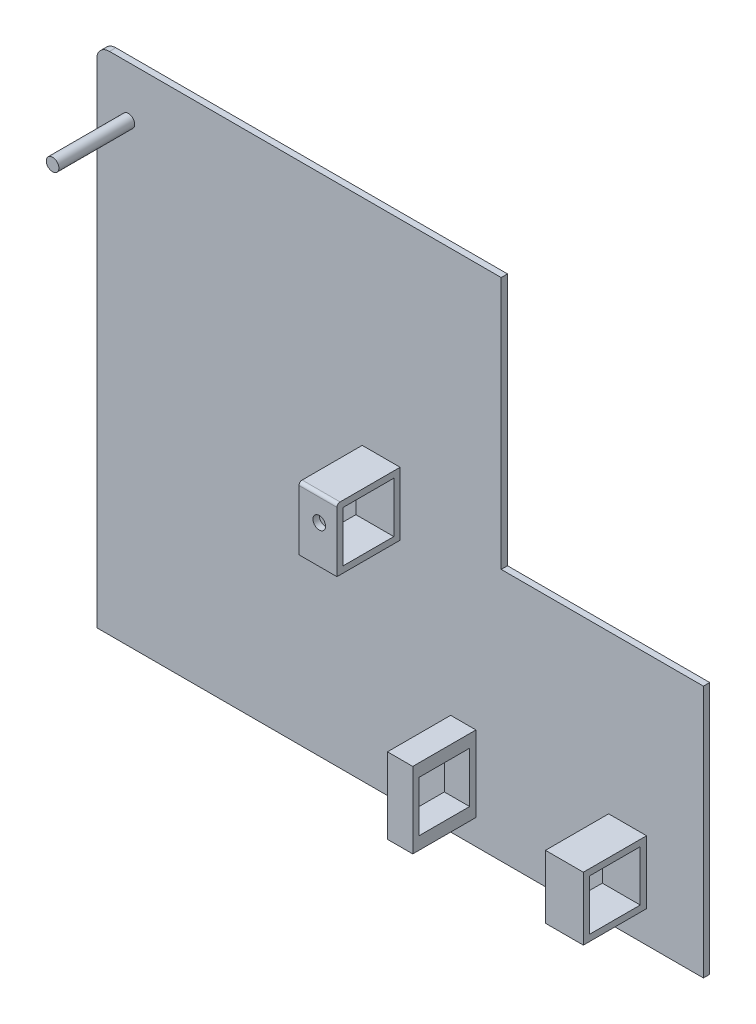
ISO-10303-21;
HEADER;
FILE_DESCRIPTION(('STEP AP214'),'2;1');
FILE_NAME('part.step','',(''),(''),'','','');
FILE_SCHEMA(('AUTOMOTIVE_DESIGN { 1 0 10303 214 1 1 1 1 }'));
ENDSEC;
DATA;
#1=APPLICATION_CONTEXT('core data for automotive mechanical design processes');
#2=APPLICATION_PROTOCOL_DEFINITION('international standard','automotive_design',2000,#1);
#3=PRODUCT_CONTEXT('',#1,'mechanical');
#4=PRODUCT('Part','Part','',(#3));
#5=PRODUCT_RELATED_PRODUCT_CATEGORY('part','',(#4));
#6=PRODUCT_DEFINITION_FORMATION('','',#4);
#7=PRODUCT_DEFINITION_CONTEXT('part definition',#1,'design');
#8=PRODUCT_DEFINITION('design','',#6,#7);
#9=PRODUCT_DEFINITION_SHAPE('','',#8);
#10=(LENGTH_UNIT() NAMED_UNIT(*) SI_UNIT(.MILLI.,.METRE.));
#11=(NAMED_UNIT(*) PLANE_ANGLE_UNIT() SI_UNIT($,.RADIAN.));
#12=(NAMED_UNIT(*) SI_UNIT($,.STERADIAN.) SOLID_ANGLE_UNIT());
#13=UNCERTAINTY_MEASURE_WITH_UNIT(LENGTH_MEASURE(1.E-05),#10,'distance_accuracy_value','');
#14=(GEOMETRIC_REPRESENTATION_CONTEXT(3) GLOBAL_UNCERTAINTY_ASSIGNED_CONTEXT((#13)) GLOBAL_UNIT_ASSIGNED_CONTEXT((#10,
#11,#12)) REPRESENTATION_CONTEXT('',''));
#15=CARTESIAN_POINT('',(0.,0.,0.));
#16=DIRECTION('',(0.,0.,1.));
#17=DIRECTION('',(1.,0.,0.));
#18=AXIS2_PLACEMENT_3D('',#15,#16,#17);
#19=CARTESIAN_POINT('',(152.4,-25.4,33.3375));
#20=DIRECTION('',(-1.,0.,0.));
#21=DIRECTION('',(0.,0.,1.));
#22=AXIS2_PLACEMENT_3D('',#19,#20,#21);
#23=PLANE('',#22);
#24=DIRECTION('',(0.,-1.,0.));
#25=VECTOR('',#24,1.);
#26=CARTESIAN_POINT('',(152.4,-63.5,33.3375));
#27=LINE('',#26,#25);
#28=CARTESIAN_POINT('',(152.4,-25.4,33.3375));
#29=VERTEX_POINT('',#28);
#30=CARTESIAN_POINT('',(152.4,-63.5,33.3375));
#31=VERTEX_POINT('',#30);
#32=EDGE_CURVE('E146',#29,#31,#27,.T.);
#33=ORIENTED_EDGE('',*,*,#32,.T.);
#34=DIRECTION('',(0.,0.,-1.));
#35=VECTOR('',#34,1.);
#36=CARTESIAN_POINT('',(152.4,-63.5,1.5875));
#37=LINE('',#36,#35);
#38=CARTESIAN_POINT('',(152.4,-63.5,1.5875));
#39=VERTEX_POINT('',#38);
#40=EDGE_CURVE('E149',#31,#39,#37,.T.);
#41=ORIENTED_EDGE('',*,*,#40,.T.);
#42=DIRECTION('',(0.,1.,0.));
#43=VECTOR('',#42,1.);
#44=CARTESIAN_POINT('',(152.4,-25.4,1.5875));
#45=LINE('',#44,#43);
#46=CARTESIAN_POINT('',(152.4,-25.4,1.5875));
#47=VERTEX_POINT('',#46);
#48=EDGE_CURVE('E152',#39,#47,#45,.T.);
#49=ORIENTED_EDGE('',*,*,#48,.T.);
#50=DIRECTION('',(0.,0.,1.));
#51=VECTOR('',#50,1.);
#52=CARTESIAN_POINT('',(152.4,-25.4,33.3375));
#53=LINE('',#52,#51);
#54=EDGE_CURVE('E154',#47,#29,#53,.T.);
#55=ORIENTED_EDGE('',*,*,#54,.T.);
#56=EDGE_LOOP('',(#33,#41,#49,#55));
#57=FACE_BOUND('',#56,.T.);
#58=DIRECTION('',(0.,-1.,0.));
#59=VECTOR('',#58,1.);
#60=CARTESIAN_POINT('',(152.4,-57.15,30.1625));
#61=LINE('',#60,#59);
#62=CARTESIAN_POINT('',(152.4,-31.75,30.1625));
#63=VERTEX_POINT('',#62);
#64=CARTESIAN_POINT('',(152.4,-57.15,30.1625));
#65=VERTEX_POINT('',#64);
#66=EDGE_CURVE('E110',#63,#65,#61,.T.);
#67=ORIENTED_EDGE('',*,*,#66,.F.);
#68=DIRECTION('',(0.,0.,1.));
#69=VECTOR('',#68,1.);
#70=CARTESIAN_POINT('',(152.4,-31.75,30.1625));
#71=LINE('',#70,#69);
#72=CARTESIAN_POINT('',(152.4,-31.75,4.7625));
#73=VERTEX_POINT('',#72);
#74=EDGE_CURVE('E132',#73,#63,#71,.T.);
#75=ORIENTED_EDGE('',*,*,#74,.F.);
#76=DIRECTION('',(0.,1.,0.));
#77=VECTOR('',#76,1.);
#78=CARTESIAN_POINT('',(152.4,-31.75,4.7625));
#79=LINE('',#78,#77);
#80=CARTESIAN_POINT('',(152.4,-57.15,4.7625));
#81=VERTEX_POINT('',#80);
#82=EDGE_CURVE('E130',#81,#73,#79,.T.);
#83=ORIENTED_EDGE('',*,*,#82,.F.);
#84=DIRECTION('',(0.,0.,-1.));
#85=VECTOR('',#84,1.);
#86=CARTESIAN_POINT('',(152.4,-57.15,4.7625));
#87=LINE('',#86,#85);
#88=EDGE_CURVE('E118',#65,#81,#87,.T.);
#89=ORIENTED_EDGE('',*,*,#88,.F.);
#90=EDGE_LOOP('',(#67,#75,#83,#89));
#91=FACE_BOUND('',#90,.T.);
#92=ADVANCED_FACE('F45',(#57,#91),#23,.F.);
#93=CARTESIAN_POINT('',(139.7,-25.4,33.3375));
#94=DIRECTION('',(-1.,0.,0.));
#95=DIRECTION('',(0.,0.,1.));
#96=AXIS2_PLACEMENT_3D('',#93,#94,#95);
#97=PLANE('',#96);
#98=DIRECTION('',(0.,-1.,0.));
#99=VECTOR('',#98,1.);
#100=CARTESIAN_POINT('',(139.7,-63.5,33.3375));
#101=LINE('',#100,#99);
#102=CARTESIAN_POINT('',(139.7,-25.4,33.3375));
#103=VERTEX_POINT('',#102);
#104=CARTESIAN_POINT('',(139.7,-63.5,33.3375));
#105=VERTEX_POINT('',#104);
#106=EDGE_CURVE('E126',#103,#105,#101,.T.);
#107=ORIENTED_EDGE('',*,*,#106,.F.);
#108=DIRECTION('',(0.,0.,1.));
#109=VECTOR('',#108,1.);
#110=CARTESIAN_POINT('',(139.7,-25.4,33.3375));
#111=LINE('',#110,#109);
#112=CARTESIAN_POINT('',(139.7,-25.4,1.5875));
#113=VERTEX_POINT('',#112);
#114=EDGE_CURVE('E150',#113,#103,#111,.T.);
#115=ORIENTED_EDGE('',*,*,#114,.F.);
#116=DIRECTION('',(0.,1.,0.));
#117=VECTOR('',#116,1.);
#118=CARTESIAN_POINT('',(139.7,-25.4,1.5875));
#119=LINE('',#118,#117);
#120=CARTESIAN_POINT('',(139.7,-63.5,1.5875));
#121=VERTEX_POINT('',#120);
#122=EDGE_CURVE('E161',#121,#113,#119,.T.);
#123=ORIENTED_EDGE('',*,*,#122,.F.);
#124=DIRECTION('',(0.,0.,-1.));
#125=VECTOR('',#124,1.);
#126=CARTESIAN_POINT('',(139.7,-63.5,1.5875));
#127=LINE('',#126,#125);
#128=EDGE_CURVE('E159',#105,#121,#127,.T.);
#129=ORIENTED_EDGE('',*,*,#128,.F.);
#130=EDGE_LOOP('',(#107,#115,#123,#129));
#131=FACE_BOUND('',#130,.T.);
#132=DIRECTION('',(0.,0.,1.));
#133=VECTOR('',#132,1.);
#134=CARTESIAN_POINT('',(139.7,-31.75,30.1625));
#135=LINE('',#134,#133);
#136=CARTESIAN_POINT('',(139.7,-31.75,4.7625));
#137=VERTEX_POINT('',#136);
#138=CARTESIAN_POINT('',(139.7,-31.75,30.1625));
#139=VERTEX_POINT('',#138);
#140=EDGE_CURVE('E119',#137,#139,#135,.T.);
#141=ORIENTED_EDGE('',*,*,#140,.T.);
#142=DIRECTION('',(0.,-1.,0.));
#143=VECTOR('',#142,1.);
#144=CARTESIAN_POINT('',(139.7,-57.15,30.1625));
#145=LINE('',#144,#143);
#146=CARTESIAN_POINT('',(139.7,-57.15,30.1625));
#147=VERTEX_POINT('',#146);
#148=EDGE_CURVE('E68',#139,#147,#145,.T.);
#149=ORIENTED_EDGE('',*,*,#148,.T.);
#150=DIRECTION('',(0.,0.,-1.));
#151=VECTOR('',#150,1.);
#152=CARTESIAN_POINT('',(139.7,-57.15,4.7625));
#153=LINE('',#152,#151);
#154=CARTESIAN_POINT('',(139.7,-57.15,4.7625));
#155=VERTEX_POINT('',#154);
#156=EDGE_CURVE('E125',#147,#155,#153,.T.);
#157=ORIENTED_EDGE('',*,*,#156,.T.);
#158=DIRECTION('',(0.,1.,0.));
#159=VECTOR('',#158,1.);
#160=CARTESIAN_POINT('',(139.7,-31.75,4.7625));
#161=LINE('',#160,#159);
#162=EDGE_CURVE('E138',#155,#137,#161,.T.);
#163=ORIENTED_EDGE('',*,*,#162,.T.);
#164=EDGE_LOOP('',(#141,#149,#157,#163));
#165=FACE_BOUND('',#164,.T.);
#166=ADVANCED_FACE('F179',(#131,#165),#97,.T.);
#167=CARTESIAN_POINT('',(152.4,-63.5,33.3375));
#168=DIRECTION('',(0.,0.,-1.));
#169=DIRECTION('',(0.,1.,0.));
#170=AXIS2_PLACEMENT_3D('',#167,#168,#169);
#171=PLANE('',#170);
#172=ORIENTED_EDGE('',*,*,#106,.T.);
#173=DIRECTION('',(-1.,0.,0.));
#174=VECTOR('',#173,1.);
#175=CARTESIAN_POINT('',(152.4,-63.5,33.3375));
#176=LINE('',#175,#174);
#177=EDGE_CURVE('E12',#31,#105,#176,.T.);
#178=ORIENTED_EDGE('',*,*,#177,.F.);
#179=ORIENTED_EDGE('',*,*,#32,.F.);
#180=DIRECTION('',(-1.,0.,0.));
#181=VECTOR('',#180,1.);
#182=CARTESIAN_POINT('',(152.4,-25.4,33.3375));
#183=LINE('',#182,#181);
#184=EDGE_CURVE('E156',#29,#103,#183,.T.);
#185=ORIENTED_EDGE('',*,*,#184,.T.);
#186=EDGE_LOOP('',(#172,#178,#179,#185));
#187=FACE_BOUND('',#186,.T.);
#188=ADVANCED_FACE('F47',(#187),#171,.F.);
#189=CARTESIAN_POINT('',(152.4,-63.5,1.5875));
#190=DIRECTION('',(0.,1.,0.));
#191=DIRECTION('',(0.,0.,1.));
#192=AXIS2_PLACEMENT_3D('',#189,#190,#191);
#193=PLANE('',#192);
#194=ORIENTED_EDGE('',*,*,#128,.T.);
#195=DIRECTION('',(-1.,0.,0.));
#196=VECTOR('',#195,1.);
#197=CARTESIAN_POINT('',(152.4,-63.5,1.5875));
#198=LINE('',#197,#196);
#199=EDGE_CURVE('E53',#39,#121,#198,.T.);
#200=ORIENTED_EDGE('',*,*,#199,.F.);
#201=ORIENTED_EDGE('',*,*,#40,.F.);
#202=ORIENTED_EDGE('',*,*,#177,.T.);
#203=EDGE_LOOP('',(#194,#200,#201,#202));
#204=FACE_BOUND('',#203,.T.);
#205=ADVANCED_FACE('F189',(#204),#193,.F.);
#206=CARTESIAN_POINT('',(152.4,-25.4,1.5875));
#207=DIRECTION('',(0.,0.,1.));
#208=DIRECTION('',(0.,-1.,0.));
#209=AXIS2_PLACEMENT_3D('',#206,#207,#208);
#210=PLANE('',#209);
#211=ORIENTED_EDGE('',*,*,#122,.T.);
#212=DIRECTION('',(-1.,0.,0.));
#213=VECTOR('',#212,1.);
#214=CARTESIAN_POINT('',(152.4,-25.4,1.5875));
#215=LINE('',#214,#213);
#216=EDGE_CURVE('E166',#47,#113,#215,.T.);
#217=ORIENTED_EDGE('',*,*,#216,.F.);
#218=ORIENTED_EDGE('',*,*,#48,.F.);
#219=ORIENTED_EDGE('',*,*,#199,.T.);
#220=EDGE_LOOP('',(#211,#217,#218,#219));
#221=FACE_BOUND('',#220,.T.);
#222=ADVANCED_FACE('F173',(#221),#210,.F.);
#223=CARTESIAN_POINT('',(152.4,-25.4,33.3375));
#224=DIRECTION('',(0.,-1.,0.));
#225=DIRECTION('',(0.,0.,-1.));
#226=AXIS2_PLACEMENT_3D('',#223,#224,#225);
#227=PLANE('',#226);
#228=ORIENTED_EDGE('',*,*,#114,.T.);
#229=ORIENTED_EDGE('',*,*,#184,.F.);
#230=ORIENTED_EDGE('',*,*,#54,.F.);
#231=ORIENTED_EDGE('',*,*,#216,.T.);
#232=EDGE_LOOP('',(#228,#229,#230,#231));
#233=FACE_BOUND('',#232,.T.);
#234=ADVANCED_FACE('F183',(#233),#227,.F.);
#235=CARTESIAN_POINT('',(152.4,-57.15,30.1625));
#236=DIRECTION('',(0.,0.,-1.));
#237=DIRECTION('',(-1.,0.,0.));
#238=AXIS2_PLACEMENT_3D('',#235,#236,#237);
#239=PLANE('',#238);
#240=ORIENTED_EDGE('',*,*,#148,.F.);
#241=DIRECTION('',(-1.,0.,0.));
#242=VECTOR('',#241,1.);
#243=CARTESIAN_POINT('',(152.4,-31.75,30.1625));
#244=LINE('',#243,#242);
#245=EDGE_CURVE('E114',#63,#139,#244,.T.);
#246=ORIENTED_EDGE('',*,*,#245,.F.);
#247=ORIENTED_EDGE('',*,*,#66,.T.);
#248=DIRECTION('',(-1.,0.,0.));
#249=VECTOR('',#248,1.);
#250=CARTESIAN_POINT('',(152.4,-57.15,30.1625));
#251=LINE('',#250,#249);
#252=EDGE_CURVE('E113',#65,#147,#251,.T.);
#253=ORIENTED_EDGE('',*,*,#252,.T.);
#254=EDGE_LOOP('',(#240,#246,#247,#253));
#255=FACE_BOUND('',#254,.T.);
#256=ADVANCED_FACE('F112',(#255),#239,.T.);
#257=CARTESIAN_POINT('',(152.4,-57.15,4.7625));
#258=DIRECTION('',(0.,1.,0.));
#259=DIRECTION('',(0.,0.,1.));
#260=AXIS2_PLACEMENT_3D('',#257,#258,#259);
#261=PLANE('',#260);
#262=ORIENTED_EDGE('',*,*,#156,.F.);
#263=ORIENTED_EDGE('',*,*,#252,.F.);
#264=ORIENTED_EDGE('',*,*,#88,.T.);
#265=DIRECTION('',(-1.,0.,0.));
#266=VECTOR('',#265,1.);
#267=CARTESIAN_POINT('',(152.4,-57.15,4.7625));
#268=LINE('',#267,#266);
#269=EDGE_CURVE('E127',#81,#155,#268,.T.);
#270=ORIENTED_EDGE('',*,*,#269,.T.);
#271=EDGE_LOOP('',(#262,#263,#264,#270));
#272=FACE_BOUND('',#271,.T.);
#273=ADVANCED_FACE('F122',(#272),#261,.T.);
#274=CARTESIAN_POINT('',(152.4,-31.75,4.7625));
#275=DIRECTION('',(0.,0.,1.));
#276=DIRECTION('',(1.,0.,0.));
#277=AXIS2_PLACEMENT_3D('',#274,#275,#276);
#278=PLANE('',#277);
#279=ORIENTED_EDGE('',*,*,#162,.F.);
#280=ORIENTED_EDGE('',*,*,#269,.F.);
#281=ORIENTED_EDGE('',*,*,#82,.T.);
#282=DIRECTION('',(-1.,0.,0.));
#283=VECTOR('',#282,1.);
#284=CARTESIAN_POINT('',(152.4,-31.75,4.7625));
#285=LINE('',#284,#283);
#286=EDGE_CURVE('E60',#73,#137,#285,.T.);
#287=ORIENTED_EDGE('',*,*,#286,.T.);
#288=EDGE_LOOP('',(#279,#280,#281,#287));
#289=FACE_BOUND('',#288,.T.);
#290=ADVANCED_FACE('F212',(#289),#278,.T.);
#291=CARTESIAN_POINT('',(152.4,-31.75,30.1625));
#292=DIRECTION('',(0.,-1.,0.));
#293=DIRECTION('',(0.,0.,-1.));
#294=AXIS2_PLACEMENT_3D('',#291,#292,#293);
#295=PLANE('',#294);
#296=ORIENTED_EDGE('',*,*,#140,.F.);
#297=ORIENTED_EDGE('',*,*,#286,.F.);
#298=ORIENTED_EDGE('',*,*,#74,.T.);
#299=ORIENTED_EDGE('',*,*,#245,.T.);
#300=EDGE_LOOP('',(#296,#297,#298,#299));
#301=FACE_BOUND('',#300,.T.);
#302=ADVANCED_FACE('F216',(#301),#295,.T.);
#303=CLOSED_SHELL('',(#92,#166,#188,#205,#222,#234,#256,#273,#290,#302));
#304=MANIFOLD_SOLID_BREP('B2',#303);
#305=CARTESIAN_POINT('',(95.25,68.2625,31.7500000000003));
#306=DIRECTION('',(-1.,0.,0.));
#307=DIRECTION('',(0.,0.,1.));
#308=AXIS2_PLACEMENT_3D('',#305,#306,#307);
#309=CYLINDRICAL_SURFACE('',#308,1.5875);
#310=DIRECTION('',(-1.,0.,0.));
#311=VECTOR('',#310,1.);
#312=CARTESIAN_POINT('',(95.25,68.2625,33.3375000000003));
#313=LINE('',#312,#311);
#314=CARTESIAN_POINT('',(114.3,68.2625,33.3375000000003));
#315=VERTEX_POINT('',#314);
#316=CARTESIAN_POINT('',(95.25,68.2625,33.3375000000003));
#317=VERTEX_POINT('',#316);
#318=EDGE_CURVE('E640',#315,#317,#313,.T.);
#319=ORIENTED_EDGE('',*,*,#318,.F.);
#320=CARTESIAN_POINT('',(114.3,68.2625,31.7500000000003));
#321=DIRECTION('',(1.,0.,0.));
#322=DIRECTION('',(0.,0.,-1.));
#323=AXIS2_PLACEMENT_3D('',#320,#321,#322);
#324=CIRCLE('',#323,1.5875);
#325=CARTESIAN_POINT('',(114.3,69.85,31.7500000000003));
#326=VERTEX_POINT('',#325);
#327=EDGE_CURVE('E288',#326,#315,#324,.T.);
#328=ORIENTED_EDGE('',*,*,#327,.F.);
#329=DIRECTION('',(-1.,0.,0.));
#330=VECTOR('',#329,1.);
#331=CARTESIAN_POINT('',(95.25,69.85,31.7500000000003));
#332=LINE('',#331,#330);
#333=CARTESIAN_POINT('',(95.25,69.85,31.7500000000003));
#334=VERTEX_POINT('',#333);
#335=EDGE_CURVE('E643',#334,#326,#332,.F.);
#336=ORIENTED_EDGE('',*,*,#335,.F.);
#337=CARTESIAN_POINT('',(95.25,68.2625,31.7500000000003));
#338=DIRECTION('',(1.,0.,0.));
#339=DIRECTION('',(0.,0.,-1.));
#340=AXIS2_PLACEMENT_3D('',#337,#338,#339);
#341=CIRCLE('',#340,1.5875);
#342=EDGE_CURVE('E43',#317,#334,#341,.F.);
#343=ORIENTED_EDGE('',*,*,#342,.F.);
#344=EDGE_LOOP('',(#319,#328,#336,#343));
#345=FACE_BOUND('',#344,.T.);
#346=ADVANCED_FACE('F281',(#345),#309,.T.);
#347=CARTESIAN_POINT('',(-31.75,171.45,-1.5875));
#348=DIRECTION('',(0.,0.,-1.));
#349=DIRECTION('',(-1.,0.,0.));
#350=AXIS2_PLACEMENT_3D('',#347,#348,#349);
#351=CYLINDRICAL_SURFACE('',#350,6.35);
#352=DIRECTION('',(0.,0.,-1.));
#353=VECTOR('',#352,1.);
#354=CARTESIAN_POINT('',(-38.1,171.45,-1.5875));
#355=LINE('',#354,#353);
#356=CARTESIAN_POINT('',(-38.1,171.45,1.5875));
#357=VERTEX_POINT('',#356);
#358=CARTESIAN_POINT('',(-38.1,171.45,-1.5875));
#359=VERTEX_POINT('',#358);
#360=EDGE_CURVE('E630',#357,#359,#355,.T.);
#361=ORIENTED_EDGE('',*,*,#360,.F.);
#362=CARTESIAN_POINT('',(-31.75,171.45,1.5875));
#363=DIRECTION('',(0.,0.,-1.));
#364=DIRECTION('',(-1.,0.,0.));
#365=AXIS2_PLACEMENT_3D('',#362,#363,#364);
#366=CIRCLE('',#365,6.35);
#367=CARTESIAN_POINT('',(-31.75,177.8,1.5875));
#368=VERTEX_POINT('',#367);
#369=EDGE_CURVE('E636',#368,#357,#366,.F.);
#370=ORIENTED_EDGE('',*,*,#369,.F.);
#371=DIRECTION('',(0.,0.,-1.));
#372=VECTOR('',#371,1.);
#373=CARTESIAN_POINT('',(-31.75,177.8,-1.5875));
#374=LINE('',#373,#372);
#375=CARTESIAN_POINT('',(-31.75,177.8,-1.5875));
#376=VERTEX_POINT('',#375);
#377=EDGE_CURVE('E633',#376,#368,#374,.F.);
#378=ORIENTED_EDGE('',*,*,#377,.F.);
#379=CARTESIAN_POINT('',(-31.75,171.45,-1.5875));
#380=DIRECTION('',(0.,0.,-1.));
#381=DIRECTION('',(-1.,0.,0.));
#382=AXIS2_PLACEMENT_3D('',#379,#380,#381);
#383=CIRCLE('',#382,6.35);
#384=EDGE_CURVE('E638',#359,#376,#383,.T.);
#385=ORIENTED_EDGE('',*,*,#384,.F.);
#386=EDGE_LOOP('',(#361,#370,#378,#385));
#387=FACE_BOUND('',#386,.T.);
#388=ADVANCED_FACE('F674',(#387),#351,.T.);
#389=CARTESIAN_POINT('',(-38.1,177.8,1.5875));
#390=DIRECTION('',(0.,0.,-1.));
#391=DIRECTION('',(-1.,0.,0.));
#392=AXIS2_PLACEMENT_3D('',#389,#390,#391);
#393=PLANE('',#392);
#394=CARTESIAN_POINT('',(-22.225,152.4,1.5875));
#395=DIRECTION('',(0.,0.,-1.));
#396=DIRECTION('',(-1.,0.,0.));
#397=AXIS2_PLACEMENT_3D('',#394,#395,#396);
#398=CIRCLE('',#397,3.175);
#399=CARTESIAN_POINT('',(-25.4,152.4,1.5875));
#400=VERTEX_POINT('',#399);
#401=EDGE_CURVE('E619',#400,#400,#398,.F.);
#402=ORIENTED_EDGE('',*,*,#401,.F.);
#403=EDGE_LOOP('',(#402));
#404=FACE_BOUND('',#403,.T.);
#405=DIRECTION('',(-1.,0.,0.));
#406=VECTOR('',#405,1.);
#407=CARTESIAN_POINT('',(-38.1,177.8,1.5875));
#408=LINE('',#407,#406);
#409=CARTESIAN_POINT('',(165.1,177.8,1.5875));
#410=VERTEX_POINT('',#409);
#411=EDGE_CURVE('E596',#410,#368,#408,.T.);
#412=ORIENTED_EDGE('',*,*,#411,.T.);
#413=ORIENTED_EDGE('',*,*,#369,.T.);
#414=DIRECTION('',(0.,-1.,0.));
#415=VECTOR('',#414,1.);
#416=CARTESIAN_POINT('',(-38.1,-76.2,1.5875));
#417=LINE('',#416,#415);
#418=CARTESIAN_POINT('',(-38.1,-76.2,1.5875));
#419=VERTEX_POINT('',#418);
#420=EDGE_CURVE('E581',#357,#419,#417,.T.);
#421=ORIENTED_EDGE('',*,*,#420,.T.);
#422=DIRECTION('',(1.,0.,0.));
#423=VECTOR('',#422,1.);
#424=CARTESIAN_POINT('',(266.7,-76.2,1.5875));
#425=LINE('',#424,#423);
#426=CARTESIAN_POINT('',(266.7,-76.2,1.5875));
#427=VERTEX_POINT('',#426);
#428=EDGE_CURVE('E584',#419,#427,#425,.T.);
#429=ORIENTED_EDGE('',*,*,#428,.T.);
#430=DIRECTION('',(0.,1.,0.));
#431=VECTOR('',#430,1.);
#432=CARTESIAN_POINT('',(266.7,50.8,1.5875));
#433=LINE('',#432,#431);
#434=CARTESIAN_POINT('',(266.7,50.8,1.5875));
#435=VERTEX_POINT('',#434);
#436=EDGE_CURVE('E587',#427,#435,#433,.T.);
#437=ORIENTED_EDGE('',*,*,#436,.T.);
#438=DIRECTION('',(-1.,0.,0.));
#439=VECTOR('',#438,1.);
#440=CARTESIAN_POINT('',(165.1,50.8,1.5875));
#441=LINE('',#440,#439);
#442=CARTESIAN_POINT('',(165.1,50.8,1.5875));
#443=VERTEX_POINT('',#442);
#444=EDGE_CURVE('E590',#435,#443,#441,.T.);
#445=ORIENTED_EDGE('',*,*,#444,.T.);
#446=DIRECTION('',(0.,1.,0.));
#447=VECTOR('',#446,1.);
#448=CARTESIAN_POINT('',(165.1,177.8,1.5875));
#449=LINE('',#448,#447);
#450=EDGE_CURVE('E593',#443,#410,#449,.T.);
#451=ORIENTED_EDGE('',*,*,#450,.T.);
#452=EDGE_LOOP('',(#412,#413,#421,#429,#437,#445,#451));
#453=FACE_BOUND('',#452,.T.);
#454=DIRECTION('',(1.,0.,0.));
#455=VECTOR('',#454,1.);
#456=CARTESIAN_POINT('',(219.075,-60.325,1.5875));
#457=LINE('',#456,#455);
#458=CARTESIAN_POINT('',(219.075,-60.325,1.5875));
#459=VERTEX_POINT('',#458);
#460=CARTESIAN_POINT('',(238.125,-60.325,1.5875));
#461=VERTEX_POINT('',#460);
#462=EDGE_CURVE('E574',#459,#461,#457,.T.);
#463=ORIENTED_EDGE('',*,*,#462,.F.);
#464=DIRECTION('',(0.,1.,0.));
#465=VECTOR('',#464,1.);
#466=CARTESIAN_POINT('',(219.075,-28.575,1.5875));
#467=LINE('',#466,#465);
#468=CARTESIAN_POINT('',(219.075,-28.575,1.5875));
#469=VERTEX_POINT('',#468);
#470=EDGE_CURVE('E553',#459,#469,#467,.T.);
#471=ORIENTED_EDGE('',*,*,#470,.T.);
#472=DIRECTION('',(1.,0.,0.));
#473=VECTOR('',#472,1.);
#474=CARTESIAN_POINT('',(219.075,-28.575,1.5875));
#475=LINE('',#474,#473);
#476=CARTESIAN_POINT('',(238.125,-28.575,1.5875));
#477=VERTEX_POINT('',#476);
#478=EDGE_CURVE('E572',#469,#477,#475,.T.);
#479=ORIENTED_EDGE('',*,*,#478,.T.);
#480=DIRECTION('',(0.,1.,0.));
#481=VECTOR('',#480,1.);
#482=CARTESIAN_POINT('',(238.125,-28.575,1.5875));
#483=LINE('',#482,#481);
#484=EDGE_CURVE('E564',#461,#477,#483,.T.);
#485=ORIENTED_EDGE('',*,*,#484,.F.);
#486=EDGE_LOOP('',(#463,#471,#479,#485));
#487=FACE_BOUND('',#486,.T.);
#488=DIRECTION('',(0.,1.,0.));
#489=VECTOR('',#488,1.);
#490=CARTESIAN_POINT('',(95.25,69.85,1.58750000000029));
#491=LINE('',#490,#489);
#492=CARTESIAN_POINT('',(95.25,38.1,1.58750000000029));
#493=VERTEX_POINT('',#492);
#494=CARTESIAN_POINT('',(95.25,69.85,1.58750000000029));
#495=VERTEX_POINT('',#494);
#496=EDGE_CURVE('E498',#493,#495,#491,.T.);
#497=ORIENTED_EDGE('',*,*,#496,.T.);
#498=DIRECTION('',(1.,0.,0.));
#499=VECTOR('',#498,1.);
#500=CARTESIAN_POINT('',(95.25,69.85,1.58750000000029));
#501=LINE('',#500,#499);
#502=CARTESIAN_POINT('',(114.3,69.85,1.58750000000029));
#503=VERTEX_POINT('',#502);
#504=EDGE_CURVE('E505',#495,#503,#501,.T.);
#505=ORIENTED_EDGE('',*,*,#504,.T.);
#506=DIRECTION('',(0.,1.,0.));
#507=VECTOR('',#506,1.);
#508=CARTESIAN_POINT('',(114.3,69.85,1.58750000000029));
#509=LINE('',#508,#507);
#510=CARTESIAN_POINT('',(114.3,38.1,1.5875));
#511=VERTEX_POINT('',#510);
#512=EDGE_CURVE('E476',#511,#503,#509,.T.);
#513=ORIENTED_EDGE('',*,*,#512,.F.);
#514=DIRECTION('',(1.,0.,0.));
#515=VECTOR('',#514,1.);
#516=CARTESIAN_POINT('',(95.25,38.1,1.58750000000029));
#517=LINE('',#516,#515);
#518=EDGE_CURVE('E509',#493,#511,#517,.T.);
#519=ORIENTED_EDGE('',*,*,#518,.F.);
#520=EDGE_LOOP('',(#497,#505,#513,#519));
#521=FACE_BOUND('',#520,.T.);
#522=ADVANCED_FACE('F659',(#404,#453,#487,#521),#393,.F.);
#523=CARTESIAN_POINT('',(-38.1,-76.2,-1.5875));
#524=DIRECTION('',(-1.,0.,0.));
#525=DIRECTION('',(0.,0.,1.));
#526=AXIS2_PLACEMENT_3D('',#523,#524,#525);
#527=PLANE('',#526);
#528=ORIENTED_EDGE('',*,*,#420,.F.);
#529=ORIENTED_EDGE('',*,*,#360,.T.);
#530=DIRECTION('',(0.,-1.,0.));
#531=VECTOR('',#530,1.);
#532=CARTESIAN_POINT('',(-38.1,-76.2,-1.5875));
#533=LINE('',#532,#531);
#534=CARTESIAN_POINT('',(-38.1,-76.2,-1.5875));
#535=VERTEX_POINT('',#534);
#536=EDGE_CURVE('E599',#359,#535,#533,.T.);
#537=ORIENTED_EDGE('',*,*,#536,.T.);
#538=DIRECTION('',(0.,0.,1.));
#539=VECTOR('',#538,1.);
#540=CARTESIAN_POINT('',(-38.1,-76.2,-1.5875));
#541=LINE('',#540,#539);
#542=EDGE_CURVE('E616',#535,#419,#541,.T.);
#543=ORIENTED_EDGE('',*,*,#542,.T.);
#544=EDGE_LOOP('',(#528,#529,#537,#543));
#545=FACE_BOUND('',#544,.T.);
#546=ADVANCED_FACE('F682',(#545),#527,.T.);
#547=CARTESIAN_POINT('',(-38.1,177.8,-1.5875));
#548=DIRECTION('',(0.,1.,0.));
#549=DIRECTION('',(0.,0.,1.));
#550=AXIS2_PLACEMENT_3D('',#547,#548,#549);
#551=PLANE('',#550);
#552=DIRECTION('',(-1.,0.,0.));
#553=VECTOR('',#552,1.);
#554=CARTESIAN_POINT('',(-38.1,177.8,-1.5875));
#555=LINE('',#554,#553);
#556=CARTESIAN_POINT('',(165.1,177.8,-1.5875));
#557=VERTEX_POINT('',#556);
#558=EDGE_CURVE('E613',#557,#376,#555,.T.);
#559=ORIENTED_EDGE('',*,*,#558,.T.);
#560=ORIENTED_EDGE('',*,*,#377,.T.);
#561=ORIENTED_EDGE('',*,*,#411,.F.);
#562=DIRECTION('',(0.,0.,1.));
#563=VECTOR('',#562,1.);
#564=CARTESIAN_POINT('',(165.1,177.8,-1.5875));
#565=LINE('',#564,#563);
#566=EDGE_CURVE('E617',#557,#410,#565,.T.);
#567=ORIENTED_EDGE('',*,*,#566,.F.);
#568=EDGE_LOOP('',(#559,#560,#561,#567));
#569=FACE_BOUND('',#568,.T.);
#570=ADVANCED_FACE('F689',(#569),#551,.T.);
#571=CARTESIAN_POINT('',(165.1,177.8,-1.5875));
#572=DIRECTION('',(1.,0.,0.));
#573=DIRECTION('',(0.,1.,0.));
#574=AXIS2_PLACEMENT_3D('',#571,#572,#573);
#575=PLANE('',#574);
#576=ORIENTED_EDGE('',*,*,#566,.T.);
#577=ORIENTED_EDGE('',*,*,#450,.F.);
#578=DIRECTION('',(0.,0.,1.));
#579=VECTOR('',#578,1.);
#580=CARTESIAN_POINT('',(165.1,50.8,-1.5875));
#581=LINE('',#580,#579);
#582=CARTESIAN_POINT('',(165.1,50.8,-1.5875));
#583=VERTEX_POINT('',#582);
#584=EDGE_CURVE('E620',#583,#443,#581,.T.);
#585=ORIENTED_EDGE('',*,*,#584,.F.);
#586=DIRECTION('',(0.,1.,0.));
#587=VECTOR('',#586,1.);
#588=CARTESIAN_POINT('',(165.1,177.8,-1.5875));
#589=LINE('',#588,#587);
#590=EDGE_CURVE('E610',#583,#557,#589,.T.);
#591=ORIENTED_EDGE('',*,*,#590,.T.);
#592=EDGE_LOOP('',(#576,#577,#585,#591));
#593=FACE_BOUND('',#592,.T.);
#594=ADVANCED_FACE('F703',(#593),#575,.T.);
#595=CARTESIAN_POINT('',(165.1,50.8,-1.5875));
#596=DIRECTION('',(0.,1.,0.));
#597=DIRECTION('',(-1.,0.,0.));
#598=AXIS2_PLACEMENT_3D('',#595,#596,#597);
#599=PLANE('',#598);
#600=ORIENTED_EDGE('',*,*,#584,.T.);
#601=ORIENTED_EDGE('',*,*,#444,.F.);
#602=DIRECTION('',(0.,0.,1.));
#603=VECTOR('',#602,1.);
#604=CARTESIAN_POINT('',(266.7,50.8,-1.5875));
#605=LINE('',#604,#603);
#606=CARTESIAN_POINT('',(266.7,50.8,-1.5875));
#607=VERTEX_POINT('',#606);
#608=EDGE_CURVE('E622',#607,#435,#605,.T.);
#609=ORIENTED_EDGE('',*,*,#608,.F.);
#610=DIRECTION('',(-1.,0.,0.));
#611=VECTOR('',#610,1.);
#612=CARTESIAN_POINT('',(165.1,50.8,-1.5875));
#613=LINE('',#612,#611);
#614=EDGE_CURVE('E607',#607,#583,#613,.T.);
#615=ORIENTED_EDGE('',*,*,#614,.T.);
#616=EDGE_LOOP('',(#600,#601,#609,#615));
#617=FACE_BOUND('',#616,.T.);
#618=ADVANCED_FACE('F699',(#617),#599,.T.);
#619=CARTESIAN_POINT('',(266.7,50.8,-1.5875));
#620=DIRECTION('',(1.,0.,0.));
#621=DIRECTION('',(0.,0.,-1.));
#622=AXIS2_PLACEMENT_3D('',#619,#620,#621);
#623=PLANE('',#622);
#624=ORIENTED_EDGE('',*,*,#608,.T.);
#625=ORIENTED_EDGE('',*,*,#436,.F.);
#626=DIRECTION('',(0.,0.,1.));
#627=VECTOR('',#626,1.);
#628=CARTESIAN_POINT('',(266.7,-76.2,-1.5875));
#629=LINE('',#628,#627);
#630=CARTESIAN_POINT('',(266.7,-76.2,-1.5875));
#631=VERTEX_POINT('',#630);
#632=EDGE_CURVE('E624',#631,#427,#629,.T.);
#633=ORIENTED_EDGE('',*,*,#632,.F.);
#634=DIRECTION('',(0.,1.,0.));
#635=VECTOR('',#634,1.);
#636=CARTESIAN_POINT('',(266.7,50.8,-1.5875));
#637=LINE('',#636,#635);
#638=EDGE_CURVE('E604',#631,#607,#637,.T.);
#639=ORIENTED_EDGE('',*,*,#638,.T.);
#640=EDGE_LOOP('',(#624,#625,#633,#639));
#641=FACE_BOUND('',#640,.T.);
#642=ADVANCED_FACE('F695',(#641),#623,.T.);
#643=CARTESIAN_POINT('',(266.7,-76.2,-1.5875));
#644=DIRECTION('',(0.,-1.,0.));
#645=DIRECTION('',(1.,0.,0.));
#646=AXIS2_PLACEMENT_3D('',#643,#644,#645);
#647=PLANE('',#646);
#648=ORIENTED_EDGE('',*,*,#632,.T.);
#649=ORIENTED_EDGE('',*,*,#428,.F.);
#650=ORIENTED_EDGE('',*,*,#542,.F.);
#651=DIRECTION('',(1.,0.,0.));
#652=VECTOR('',#651,1.);
#653=CARTESIAN_POINT('',(266.7,-76.2,-1.5875));
#654=LINE('',#653,#652);
#655=EDGE_CURVE('E601',#535,#631,#654,.T.);
#656=ORIENTED_EDGE('',*,*,#655,.T.);
#657=EDGE_LOOP('',(#648,#649,#650,#656));
#658=FACE_BOUND('',#657,.T.);
#659=ADVANCED_FACE('F691',(#658),#647,.T.);
#660=CARTESIAN_POINT('',(-38.1,177.8,-1.5875));
#661=DIRECTION('',(0.,0.,-1.));
#662=DIRECTION('',(-1.,0.,0.));
#663=AXIS2_PLACEMENT_3D('',#660,#661,#662);
#664=PLANE('',#663);
#665=ORIENTED_EDGE('',*,*,#536,.F.);
#666=ORIENTED_EDGE('',*,*,#384,.T.);
#667=ORIENTED_EDGE('',*,*,#558,.F.);
#668=ORIENTED_EDGE('',*,*,#590,.F.);
#669=ORIENTED_EDGE('',*,*,#614,.F.);
#670=ORIENTED_EDGE('',*,*,#638,.F.);
#671=ORIENTED_EDGE('',*,*,#655,.F.);
#672=EDGE_LOOP('',(#665,#666,#667,#668,#669,#670,#671));
#673=FACE_BOUND('',#672,.T.);
#674=ADVANCED_FACE('F694',(#673),#664,.T.);
#675=CARTESIAN_POINT('',(-22.225,152.4,39.6875));
#676=DIRECTION('',(0.,0.,-1.));
#677=DIRECTION('',(-1.,0.,0.));
#678=AXIS2_PLACEMENT_3D('',#675,#676,#677);
#679=CYLINDRICAL_SURFACE('',#678,3.175);
#680=CARTESIAN_POINT('',(-22.225,152.4,39.6875));
#681=DIRECTION('',(0.,0.,1.));
#682=DIRECTION('',(1.,0.,0.));
#683=AXIS2_PLACEMENT_3D('',#680,#681,#682);
#684=CIRCLE('',#683,3.175);
#685=CARTESIAN_POINT('',(-25.4,152.4,39.6875));
#686=VERTEX_POINT('',#685);
#687=EDGE_CURVE('E571',#686,#686,#684,.T.);
#688=CARTESIAN_POINT('',(-25.4,152.4,39.6875));
#689=CARTESIAN_POINT('',(-25.4,152.4,39.290625));
#690=CARTESIAN_POINT('',(-25.4,152.4,38.89375));
#691=CARTESIAN_POINT('',(-25.4,152.4,38.1));
#692=CARTESIAN_POINT('',(-25.4,152.4,37.703125));
#693=CARTESIAN_POINT('',(-25.4,152.4,36.909375));
#694=CARTESIAN_POINT('',(-25.4,152.4,36.5125));
#695=CARTESIAN_POINT('',(-25.4,152.4,35.71875));
#696=CARTESIAN_POINT('',(-25.4,152.4,35.321875));
#697=CARTESIAN_POINT('',(-25.4,152.4,34.528125));
#698=CARTESIAN_POINT('',(-25.4,152.4,34.13125));
#699=CARTESIAN_POINT('',(-25.4,152.4,33.3375));
#700=CARTESIAN_POINT('',(-25.4,152.4,32.940625));
#701=CARTESIAN_POINT('',(-25.4,152.4,32.146875));
#702=CARTESIAN_POINT('',(-25.4,152.4,31.75));
#703=CARTESIAN_POINT('',(-25.4,152.4,30.95625));
#704=CARTESIAN_POINT('',(-25.4,152.4,30.559375));
#705=CARTESIAN_POINT('',(-25.4,152.4,29.765625));
#706=CARTESIAN_POINT('',(-25.4,152.4,29.36875));
#707=CARTESIAN_POINT('',(-25.4,152.4,28.575));
#708=CARTESIAN_POINT('',(-25.4,152.4,28.178125));
#709=CARTESIAN_POINT('',(-25.4,152.4,27.384375));
#710=CARTESIAN_POINT('',(-25.4,152.4,26.9875));
#711=CARTESIAN_POINT('',(-25.4,152.4,26.19375));
#712=CARTESIAN_POINT('',(-25.4,152.4,25.796875));
#713=CARTESIAN_POINT('',(-25.4,152.4,25.003125));
#714=CARTESIAN_POINT('',(-25.4,152.4,24.60625));
#715=CARTESIAN_POINT('',(-25.4,152.4,23.8125));
#716=CARTESIAN_POINT('',(-25.4,152.4,23.415625));
#717=CARTESIAN_POINT('',(-25.4,152.4,22.621875));
#718=CARTESIAN_POINT('',(-25.4,152.4,22.225));
#719=CARTESIAN_POINT('',(-25.4,152.4,21.43125));
#720=CARTESIAN_POINT('',(-25.4,152.4,21.034375));
#721=CARTESIAN_POINT('',(-25.4,152.4,20.240625));
#722=CARTESIAN_POINT('',(-25.4,152.4,19.84375));
#723=CARTESIAN_POINT('',(-25.4,152.4,19.05));
#724=CARTESIAN_POINT('',(-25.4,152.4,18.653125));
#725=CARTESIAN_POINT('',(-25.4,152.4,17.859375));
#726=CARTESIAN_POINT('',(-25.4,152.4,17.4625));
#727=CARTESIAN_POINT('',(-25.4,152.4,16.66875));
#728=CARTESIAN_POINT('',(-25.4,152.4,16.271875));
#729=CARTESIAN_POINT('',(-25.4,152.4,15.478125));
#730=CARTESIAN_POINT('',(-25.4,152.4,15.08125));
#731=CARTESIAN_POINT('',(-25.4,152.4,14.2875));
#732=CARTESIAN_POINT('',(-25.4,152.4,13.890625));
#733=CARTESIAN_POINT('',(-25.4,152.4,13.096875));
#734=CARTESIAN_POINT('',(-25.4,152.4,12.7));
#735=CARTESIAN_POINT('',(-25.4,152.4,11.90625));
#736=CARTESIAN_POINT('',(-25.4,152.4,11.509375));
#737=CARTESIAN_POINT('',(-25.4,152.4,10.715625));
#738=CARTESIAN_POINT('',(-25.4,152.4,10.31875));
#739=CARTESIAN_POINT('',(-25.4,152.4,9.525));
#740=CARTESIAN_POINT('',(-25.4,152.4,9.128125));
#741=CARTESIAN_POINT('',(-25.4,152.4,8.334375));
#742=CARTESIAN_POINT('',(-25.4,152.4,7.9375));
#743=CARTESIAN_POINT('',(-25.4,152.4,7.14375));
#744=CARTESIAN_POINT('',(-25.4,152.4,6.746875));
#745=CARTESIAN_POINT('',(-25.4,152.4,5.953125));
#746=CARTESIAN_POINT('',(-25.4,152.4,5.55625));
#747=CARTESIAN_POINT('',(-25.4,152.4,4.7625));
#748=CARTESIAN_POINT('',(-25.4,152.4,4.365625));
#749=CARTESIAN_POINT('',(-25.4,152.4,3.571875));
#750=CARTESIAN_POINT('',(-25.4,152.4,3.175));
#751=CARTESIAN_POINT('',(-25.4,152.4,2.38125));
#752=CARTESIAN_POINT('',(-25.4,152.4,1.984375));
#753=CARTESIAN_POINT('',(-25.4,152.4,1.5875));
#754=B_SPLINE_CURVE_WITH_KNOTS('',3,(#688,#689,#690,#691,#692,#693,#694,#695,#696,#697,#698,
#699,#700,#701,#702,#703,#704,#705,#706,#707,#708,#709,#710,#711,#712,#713,#714,#715,#716,#717,
#718,#719,#720,#721,#722,#723,#724,#725,#726,#727,#728,#729,#730,#731,#732,#733,#734,#735,#736,
#737,#738,#739,#740,#741,#742,#743,#744,#745,#746,#747,#748,#749,#750,#751,#752,#753),
.UNSPECIFIED.,.F.,.F.,(4,2,2,2,2,2,2,2,2,2,2,2,2,2,2,2,2,2,2,2,2,2,2,2,2,2,2,2,2,2,2,2,4),(0.,
1.19062499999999,2.38124999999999,3.571875,4.7625,5.953125,7.14375,8.334375,9.525,10.715625,
11.90625,13.096875,14.2875,15.478125,16.66875,17.859375,19.05,20.240625,21.43125,22.621875,
23.8125,25.003125,26.19375,27.384375,28.575,29.765625,30.95625,32.146875,33.3375,34.528125,
35.71875,36.909375,38.1),.UNSPECIFIED.);
#755=EDGE_CURVE('BSEAM712',#686,#400,#754,.T.);
#756=ORIENTED_EDGE('',*,*,#687,.F.);
#757=ORIENTED_EDGE('',*,*,#401,.T.);
#758=ORIENTED_EDGE('',*,*,#755,.T.);
#759=ORIENTED_EDGE('',*,*,#755,.F.);
#760=EDGE_LOOP('',(#756,#758,#757,#759));
#761=FACE_BOUND('',#760,.T.);
#762=ADVANCED_FACE('F712',(#761),#679,.T.);
#763=CARTESIAN_POINT('',(-22.225,152.4,39.6875));
#764=DIRECTION('',(0.,0.,1.));
#765=DIRECTION('',(1.,0.,0.));
#766=AXIS2_PLACEMENT_3D('',#763,#764,#765);
#767=PLANE('',#766);
#768=ORIENTED_EDGE('',*,*,#687,.T.);
#769=EDGE_LOOP('',(#768));
#770=FACE_BOUND('',#769,.T.);
#771=ADVANCED_FACE('F717',(#770),#767,.T.);
#772=CARTESIAN_POINT('',(219.075,-60.325,33.3375));
#773=DIRECTION('',(0.,0.,1.));
#774=DIRECTION('',(1.,0.,0.));
#775=AXIS2_PLACEMENT_3D('',#772,#773,#774);
#776=PLANE('',#775);
#777=DIRECTION('',(0.,-1.,0.));
#778=VECTOR('',#777,1.);
#779=CARTESIAN_POINT('',(238.125,-60.325,33.3375));
#780=LINE('',#779,#778);
#781=CARTESIAN_POINT('',(238.125,-28.575,33.3375));
#782=VERTEX_POINT('',#781);
#783=CARTESIAN_POINT('',(238.125,-60.325,33.3375));
#784=VERTEX_POINT('',#783);
#785=EDGE_CURVE('E539',#782,#784,#780,.T.);
#786=ORIENTED_EDGE('',*,*,#785,.F.);
#787=DIRECTION('',(1.,0.,0.));
#788=VECTOR('',#787,1.);
#789=CARTESIAN_POINT('',(219.075,-28.575,33.3375));
#790=LINE('',#789,#788);
#791=CARTESIAN_POINT('',(219.075,-28.575,33.3375));
#792=VERTEX_POINT('',#791);
#793=EDGE_CURVE('E569',#792,#782,#790,.T.);
#794=ORIENTED_EDGE('',*,*,#793,.F.);
#795=DIRECTION('',(0.,-1.,0.));
#796=VECTOR('',#795,1.);
#797=CARTESIAN_POINT('',(219.075,-60.325,33.3375));
#798=LINE('',#797,#796);
#799=CARTESIAN_POINT('',(219.075,-60.325,33.3375));
#800=VERTEX_POINT('',#799);
#801=EDGE_CURVE('E546',#792,#800,#798,.T.);
#802=ORIENTED_EDGE('',*,*,#801,.T.);
#803=DIRECTION('',(1.,0.,0.));
#804=VECTOR('',#803,1.);
#805=CARTESIAN_POINT('',(219.075,-60.325,33.3375));
#806=LINE('',#805,#804);
#807=EDGE_CURVE('E558',#800,#784,#806,.T.);
#808=ORIENTED_EDGE('',*,*,#807,.T.);
#809=EDGE_LOOP('',(#786,#794,#802,#808));
#810=FACE_BOUND('',#809,.T.);
#811=ADVANCED_FACE('F721',(#810),#776,.T.);
#812=CARTESIAN_POINT('',(219.075,-28.575,33.3375));
#813=DIRECTION('',(0.,1.,0.));
#814=DIRECTION('',(0.,0.,1.));
#815=AXIS2_PLACEMENT_3D('',#812,#813,#814);
#816=PLANE('',#815);
#817=DIRECTION('',(0.,0.,1.));
#818=VECTOR('',#817,1.);
#819=CARTESIAN_POINT('',(238.125,-28.575,33.3375));
#820=LINE('',#819,#818);
#821=EDGE_CURVE('E550',#477,#782,#820,.T.);
#822=ORIENTED_EDGE('',*,*,#821,.F.);
#823=ORIENTED_EDGE('',*,*,#478,.F.);
#824=DIRECTION('',(0.,0.,1.));
#825=VECTOR('',#824,1.);
#826=CARTESIAN_POINT('',(219.075,-28.575,33.3375));
#827=LINE('',#826,#825);
#828=EDGE_CURVE('E555',#469,#792,#827,.T.);
#829=ORIENTED_EDGE('',*,*,#828,.T.);
#830=ORIENTED_EDGE('',*,*,#793,.T.);
#831=EDGE_LOOP('',(#822,#823,#829,#830));
#832=FACE_BOUND('',#831,.T.);
#833=ADVANCED_FACE('F725',(#832),#816,.T.);
#834=CARTESIAN_POINT('',(219.075,-60.325,1.5875));
#835=DIRECTION('',(0.,-1.,0.));
#836=DIRECTION('',(0.,0.,-1.));
#837=AXIS2_PLACEMENT_3D('',#834,#835,#836);
#838=PLANE('',#837);
#839=DIRECTION('',(0.,0.,-1.));
#840=VECTOR('',#839,1.);
#841=CARTESIAN_POINT('',(238.125,-60.325,1.5875));
#842=LINE('',#841,#840);
#843=EDGE_CURVE('E561',#784,#461,#842,.T.);
#844=ORIENTED_EDGE('',*,*,#843,.F.);
#845=ORIENTED_EDGE('',*,*,#807,.F.);
#846=DIRECTION('',(0.,0.,-1.));
#847=VECTOR('',#846,1.);
#848=CARTESIAN_POINT('',(219.075,-60.325,1.5875));
#849=LINE('',#848,#847);
#850=EDGE_CURVE('E549',#800,#459,#849,.T.);
#851=ORIENTED_EDGE('',*,*,#850,.T.);
#852=ORIENTED_EDGE('',*,*,#462,.T.);
#853=EDGE_LOOP('',(#844,#845,#851,#852));
#854=FACE_BOUND('',#853,.T.);
#855=ADVANCED_FACE('F727',(#854),#838,.T.);
#856=CARTESIAN_POINT('',(219.075,-28.575,33.3375));
#857=DIRECTION('',(-1.,0.,0.));
#858=DIRECTION('',(0.,0.,1.));
#859=AXIS2_PLACEMENT_3D('',#856,#857,#858);
#860=PLANE('',#859);
#861=DIRECTION('',(0.,-1.,0.));
#862=VECTOR('',#861,1.);
#863=CARTESIAN_POINT('',(219.075,-57.15,30.1625));
#864=LINE('',#863,#862);
#865=CARTESIAN_POINT('',(219.075,-31.75,30.1625));
#866=VERTEX_POINT('',#865);
#867=CARTESIAN_POINT('',(219.075,-57.15,30.1625));
#868=VERTEX_POINT('',#867);
#869=EDGE_CURVE('E514',#866,#868,#864,.T.);
#870=ORIENTED_EDGE('',*,*,#869,.T.);
#871=DIRECTION('',(0.,0.,-1.));
#872=VECTOR('',#871,1.);
#873=CARTESIAN_POINT('',(219.075,-57.15,4.7625));
#874=LINE('',#873,#872);
#875=CARTESIAN_POINT('',(219.075,-57.15,4.7625));
#876=VERTEX_POINT('',#875);
#877=EDGE_CURVE('E517',#868,#876,#874,.T.);
#878=ORIENTED_EDGE('',*,*,#877,.T.);
#879=DIRECTION('',(0.,1.,0.));
#880=VECTOR('',#879,1.);
#881=CARTESIAN_POINT('',(219.075,-31.75,4.7625));
#882=LINE('',#881,#880);
#883=CARTESIAN_POINT('',(219.075,-31.75,4.7625));
#884=VERTEX_POINT('',#883);
#885=EDGE_CURVE('E521',#876,#884,#882,.T.);
#886=ORIENTED_EDGE('',*,*,#885,.T.);
#887=DIRECTION('',(0.,0.,1.));
#888=VECTOR('',#887,1.);
#889=CARTESIAN_POINT('',(219.075,-31.75,30.1625));
#890=LINE('',#889,#888);
#891=EDGE_CURVE('E524',#884,#866,#890,.T.);
#892=ORIENTED_EDGE('',*,*,#891,.T.);
#893=EDGE_LOOP('',(#870,#878,#886,#892));
#894=FACE_BOUND('',#893,.T.);
#895=ORIENTED_EDGE('',*,*,#801,.F.);
#896=ORIENTED_EDGE('',*,*,#828,.F.);
#897=ORIENTED_EDGE('',*,*,#470,.F.);
#898=ORIENTED_EDGE('',*,*,#850,.F.);
#899=EDGE_LOOP('',(#895,#896,#897,#898));
#900=FACE_BOUND('',#899,.T.);
#901=ADVANCED_FACE('F730',(#894,#900),#860,.T.);
#902=CARTESIAN_POINT('',(238.125,-28.575,33.3375));
#903=DIRECTION('',(-1.,0.,0.));
#904=DIRECTION('',(0.,0.,1.));
#905=AXIS2_PLACEMENT_3D('',#902,#903,#904);
#906=PLANE('',#905);
#907=DIRECTION('',(0.,0.,-1.));
#908=VECTOR('',#907,1.);
#909=CARTESIAN_POINT('',(238.125,-57.15,4.7625));
#910=LINE('',#909,#908);
#911=CARTESIAN_POINT('',(238.125,-57.15,30.1625));
#912=VERTEX_POINT('',#911);
#913=CARTESIAN_POINT('',(238.125,-57.15,4.7625));
#914=VERTEX_POINT('',#913);
#915=EDGE_CURVE('E529',#912,#914,#910,.T.);
#916=ORIENTED_EDGE('',*,*,#915,.F.);
#917=DIRECTION('',(0.,-1.,0.));
#918=VECTOR('',#917,1.);
#919=CARTESIAN_POINT('',(238.125,-57.15,30.1625));
#920=LINE('',#919,#918);
#921=CARTESIAN_POINT('',(238.125,-31.75,30.1625));
#922=VERTEX_POINT('',#921);
#923=EDGE_CURVE('E508',#922,#912,#920,.T.);
#924=ORIENTED_EDGE('',*,*,#923,.F.);
#925=DIRECTION('',(0.,0.,1.));
#926=VECTOR('',#925,1.);
#927=CARTESIAN_POINT('',(238.125,-31.75,30.1625));
#928=LINE('',#927,#926);
#929=CARTESIAN_POINT('',(238.125,-31.75,4.7625));
#930=VERTEX_POINT('',#929);
#931=EDGE_CURVE('E518',#930,#922,#928,.T.);
#932=ORIENTED_EDGE('',*,*,#931,.F.);
#933=DIRECTION('',(0.,1.,0.));
#934=VECTOR('',#933,1.);
#935=CARTESIAN_POINT('',(238.125,-31.75,4.7625));
#936=LINE('',#935,#934);
#937=EDGE_CURVE('E532',#914,#930,#936,.T.);
#938=ORIENTED_EDGE('',*,*,#937,.F.);
#939=EDGE_LOOP('',(#916,#924,#932,#938));
#940=FACE_BOUND('',#939,.T.);
#941=ORIENTED_EDGE('',*,*,#785,.T.);
#942=ORIENTED_EDGE('',*,*,#843,.T.);
#943=ORIENTED_EDGE('',*,*,#484,.T.);
#944=ORIENTED_EDGE('',*,*,#821,.T.);
#945=EDGE_LOOP('',(#941,#942,#943,#944));
#946=FACE_BOUND('',#945,.T.);
#947=ADVANCED_FACE('F735',(#940,#946),#906,.F.);
#948=CARTESIAN_POINT('',(219.075,-57.15,30.1625));
#949=DIRECTION('',(0.,0.,1.));
#950=DIRECTION('',(1.,0.,0.));
#951=AXIS2_PLACEMENT_3D('',#948,#949,#950);
#952=PLANE('',#951);
#953=ORIENTED_EDGE('',*,*,#923,.T.);
#954=DIRECTION('',(1.,0.,0.));
#955=VECTOR('',#954,1.);
#956=CARTESIAN_POINT('',(219.075,-57.15,30.1625));
#957=LINE('',#956,#955);
#958=EDGE_CURVE('E527',#868,#912,#957,.T.);
#959=ORIENTED_EDGE('',*,*,#958,.F.);
#960=ORIENTED_EDGE('',*,*,#869,.F.);
#961=DIRECTION('',(1.,0.,0.));
#962=VECTOR('',#961,1.);
#963=CARTESIAN_POINT('',(219.075,-31.75,30.1625));
#964=LINE('',#963,#962);
#965=EDGE_CURVE('E537',#866,#922,#964,.T.);
#966=ORIENTED_EDGE('',*,*,#965,.T.);
#967=EDGE_LOOP('',(#953,#959,#960,#966));
#968=FACE_BOUND('',#967,.T.);
#969=ADVANCED_FACE('F738',(#968),#952,.F.);
#970=CARTESIAN_POINT('',(219.075,-31.75,30.1625));
#971=DIRECTION('',(0.,1.,0.));
#972=DIRECTION('',(0.,0.,1.));
#973=AXIS2_PLACEMENT_3D('',#970,#971,#972);
#974=PLANE('',#973);
#975=ORIENTED_EDGE('',*,*,#931,.T.);
#976=ORIENTED_EDGE('',*,*,#965,.F.);
#977=ORIENTED_EDGE('',*,*,#891,.F.);
#978=DIRECTION('',(1.,0.,0.));
#979=VECTOR('',#978,1.);
#980=CARTESIAN_POINT('',(219.075,-31.75,4.7625));
#981=LINE('',#980,#979);
#982=EDGE_CURVE('E540',#884,#930,#981,.T.);
#983=ORIENTED_EDGE('',*,*,#982,.T.);
#984=EDGE_LOOP('',(#975,#976,#977,#983));
#985=FACE_BOUND('',#984,.T.);
#986=ADVANCED_FACE('F745',(#985),#974,.F.);
#987=CARTESIAN_POINT('',(219.075,-31.75,4.7625));
#988=DIRECTION('',(0.,0.,-1.));
#989=DIRECTION('',(-1.,0.,0.));
#990=AXIS2_PLACEMENT_3D('',#987,#988,#989);
#991=PLANE('',#990);
#992=ORIENTED_EDGE('',*,*,#937,.T.);
#993=ORIENTED_EDGE('',*,*,#982,.F.);
#994=ORIENTED_EDGE('',*,*,#885,.F.);
#995=DIRECTION('',(1.,0.,0.));
#996=VECTOR('',#995,1.);
#997=CARTESIAN_POINT('',(219.075,-57.15,4.7625));
#998=LINE('',#997,#996);
#999=EDGE_CURVE('E542',#876,#914,#998,.T.);
#1000=ORIENTED_EDGE('',*,*,#999,.T.);
#1001=EDGE_LOOP('',(#992,#993,#994,#1000));
#1002=FACE_BOUND('',#1001,.T.);
#1003=ADVANCED_FACE('F750',(#1002),#991,.F.);
#1004=CARTESIAN_POINT('',(219.075,-57.15,4.7625));
#1005=DIRECTION('',(0.,-1.,0.));
#1006=DIRECTION('',(0.,0.,-1.));
#1007=AXIS2_PLACEMENT_3D('',#1004,#1005,#1006);
#1008=PLANE('',#1007);
#1009=ORIENTED_EDGE('',*,*,#915,.T.);
#1010=ORIENTED_EDGE('',*,*,#999,.F.);
#1011=ORIENTED_EDGE('',*,*,#877,.F.);
#1012=ORIENTED_EDGE('',*,*,#958,.T.);
#1013=EDGE_LOOP('',(#1009,#1010,#1011,#1012));
#1014=FACE_BOUND('',#1013,.T.);
#1015=ADVANCED_FACE('F747',(#1014),#1008,.F.);
#1016=CARTESIAN_POINT('',(95.25,38.1,33.3375000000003));
#1017=DIRECTION('',(0.,0.,1.));
#1018=DIRECTION('',(0.,-1.,0.));
#1019=AXIS2_PLACEMENT_3D('',#1016,#1017,#1018);
#1020=PLANE('',#1019);
#1021=CARTESIAN_POINT('',(105.41,57.15,33.3375000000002));
#1022=DIRECTION('',(0.,0.,1.));
#1023=DIRECTION('',(1.,0.,0.));
#1024=AXIS2_PLACEMENT_3D('',#1021,#1022,#1023);
#1025=CIRCLE('',#1024,3.175);
#1026=CARTESIAN_POINT('',(108.585,57.15,33.3375000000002));
#1027=VERTEX_POINT('',#1026);
#1028=EDGE_CURVE('E958',#1027,#1027,#1025,.T.);
#1029=ORIENTED_EDGE('',*,*,#1028,.F.);
#1030=EDGE_LOOP('',(#1029));
#1031=FACE_BOUND('',#1030,.T.);
#1032=DIRECTION('',(0.,-1.,0.));
#1033=VECTOR('',#1032,1.);
#1034=CARTESIAN_POINT('',(114.3,38.1,33.3375000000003));
#1035=LINE('',#1034,#1033);
#1036=CARTESIAN_POINT('',(114.3,38.1,33.3375000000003));
#1037=VERTEX_POINT('',#1036);
#1038=EDGE_CURVE('E472',#315,#1037,#1035,.T.);
#1039=ORIENTED_EDGE('',*,*,#1038,.F.);
#1040=ORIENTED_EDGE('',*,*,#318,.T.);
#1041=DIRECTION('',(0.,-1.,0.));
#1042=VECTOR('',#1041,1.);
#1043=CARTESIAN_POINT('',(95.25,38.1,33.3375000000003));
#1044=LINE('',#1043,#1042);
#1045=CARTESIAN_POINT('',(95.25,38.1,33.3375000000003));
#1046=VERTEX_POINT('',#1045);
#1047=EDGE_CURVE('E490',#317,#1046,#1044,.T.);
#1048=ORIENTED_EDGE('',*,*,#1047,.T.);
#1049=DIRECTION('',(1.,0.,0.));
#1050=VECTOR('',#1049,1.);
#1051=CARTESIAN_POINT('',(95.25,38.1,33.3375000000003));
#1052=LINE('',#1051,#1050);
#1053=EDGE_CURVE('E504',#1046,#1037,#1052,.T.);
#1054=ORIENTED_EDGE('',*,*,#1053,.T.);
#1055=EDGE_LOOP('',(#1039,#1040,#1048,#1054));
#1056=FACE_BOUND('',#1055,.T.);
#1057=ADVANCED_FACE('F648',(#1031,#1056),#1020,.T.);
#1058=CARTESIAN_POINT('',(95.25,69.85,33.3375000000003));
#1059=DIRECTION('',(0.,1.,0.));
#1060=DIRECTION('',(0.,0.,1.));
#1061=AXIS2_PLACEMENT_3D('',#1058,#1059,#1060);
#1062=PLANE('',#1061);
#1063=DIRECTION('',(0.,0.,1.));
#1064=VECTOR('',#1063,1.);
#1065=CARTESIAN_POINT('',(95.25,69.85,33.3375000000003));
#1066=LINE('',#1065,#1064);
#1067=EDGE_CURVE('E501',#495,#334,#1066,.T.);
#1068=ORIENTED_EDGE('',*,*,#1067,.T.);
#1069=ORIENTED_EDGE('',*,*,#335,.T.);
#1070=DIRECTION('',(0.,0.,1.));
#1071=VECTOR('',#1070,1.);
#1072=CARTESIAN_POINT('',(114.3,69.85,33.3375000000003));
#1073=LINE('',#1072,#1071);
#1074=EDGE_CURVE('E478',#503,#326,#1073,.T.);
#1075=ORIENTED_EDGE('',*,*,#1074,.F.);
#1076=ORIENTED_EDGE('',*,*,#504,.F.);
#1077=EDGE_LOOP('',(#1068,#1069,#1075,#1076));
#1078=FACE_BOUND('',#1077,.T.);
#1079=ADVANCED_FACE('F658',(#1078),#1062,.T.);
#1080=CARTESIAN_POINT('',(95.25,38.1,1.58750000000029));
#1081=DIRECTION('',(0.,-1.,0.));
#1082=DIRECTION('',(0.,0.,-1.));
#1083=AXIS2_PLACEMENT_3D('',#1080,#1081,#1082);
#1084=PLANE('',#1083);
#1085=ORIENTED_EDGE('',*,*,#518,.T.);
#1086=DIRECTION('',(0.,0.,-1.));
#1087=VECTOR('',#1086,1.);
#1088=CARTESIAN_POINT('',(114.3,38.1,1.58750000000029));
#1089=LINE('',#1088,#1087);
#1090=EDGE_CURVE('E474',#1037,#511,#1089,.T.);
#1091=ORIENTED_EDGE('',*,*,#1090,.F.);
#1092=ORIENTED_EDGE('',*,*,#1053,.F.);
#1093=DIRECTION('',(0.,0.,-1.));
#1094=VECTOR('',#1093,1.);
#1095=CARTESIAN_POINT('',(95.25,38.1,1.58750000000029));
#1096=LINE('',#1095,#1094);
#1097=EDGE_CURVE('E495',#1046,#493,#1096,.T.);
#1098=ORIENTED_EDGE('',*,*,#1097,.T.);
#1099=EDGE_LOOP('',(#1085,#1091,#1092,#1098));
#1100=FACE_BOUND('',#1099,.T.);
#1101=ADVANCED_FACE('F653',(#1100),#1084,.T.);
#1102=CARTESIAN_POINT('',(95.25,38.1,33.3375000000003));
#1103=DIRECTION('',(1.,0.,0.));
#1104=DIRECTION('',(0.,0.,-1.));
#1105=AXIS2_PLACEMENT_3D('',#1102,#1103,#1104);
#1106=PLANE('',#1105);
#1107=DIRECTION('',(0.,0.,1.));
#1108=VECTOR('',#1107,1.);
#1109=CARTESIAN_POINT('',(95.25,66.675,30.1625000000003));
#1110=LINE('',#1109,#1108);
#1111=CARTESIAN_POINT('',(95.25,66.675,4.76250000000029));
#1112=VERTEX_POINT('',#1111);
#1113=CARTESIAN_POINT('',(95.25,66.675,30.1625000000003));
#1114=VERTEX_POINT('',#1113);
#1115=EDGE_CURVE('E452',#1112,#1114,#1110,.T.);
#1116=ORIENTED_EDGE('',*,*,#1115,.T.);
#1117=DIRECTION('',(0.,-1.,0.));
#1118=VECTOR('',#1117,1.);
#1119=CARTESIAN_POINT('',(95.25,41.275,30.1625000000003));
#1120=LINE('',#1119,#1118);
#1121=CARTESIAN_POINT('',(95.25,41.275,30.1625000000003));
#1122=VERTEX_POINT('',#1121);
#1123=EDGE_CURVE('E481',#1114,#1122,#1120,.T.);
#1124=ORIENTED_EDGE('',*,*,#1123,.T.);
#1125=DIRECTION('',(0.,0.,-1.));
#1126=VECTOR('',#1125,1.);
#1127=CARTESIAN_POINT('',(95.25,41.275,4.76250000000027));
#1128=LINE('',#1127,#1126);
#1129=CARTESIAN_POINT('',(95.25,41.275,4.76250000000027));
#1130=VERTEX_POINT('',#1129);
#1131=EDGE_CURVE('E447',#1122,#1130,#1128,.T.);
#1132=ORIENTED_EDGE('',*,*,#1131,.T.);
#1133=DIRECTION('',(0.,1.,0.));
#1134=VECTOR('',#1133,1.);
#1135=CARTESIAN_POINT('',(95.25,66.675,4.76250000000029));
#1136=LINE('',#1135,#1134);
#1137=EDGE_CURVE('E484',#1130,#1112,#1136,.T.);
#1138=ORIENTED_EDGE('',*,*,#1137,.T.);
#1139=EDGE_LOOP('',(#1116,#1124,#1132,#1138));
#1140=FACE_BOUND('',#1139,.T.);
#1141=ORIENTED_EDGE('',*,*,#1047,.F.);
#1142=ORIENTED_EDGE('',*,*,#342,.T.);
#1143=ORIENTED_EDGE('',*,*,#1067,.F.);
#1144=ORIENTED_EDGE('',*,*,#496,.F.);
#1145=ORIENTED_EDGE('',*,*,#1097,.F.);
#1146=EDGE_LOOP('',(#1141,#1142,#1143,#1144,#1145));
#1147=FACE_BOUND('',#1146,.T.);
#1148=ADVANCED_FACE('F660',(#1140,#1147),#1106,.F.);
#1149=CARTESIAN_POINT('',(95.25,41.275,30.1625000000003));
#1150=DIRECTION('',(0.,0.,1.));
#1151=DIRECTION('',(0.,-1.,0.));
#1152=AXIS2_PLACEMENT_3D('',#1149,#1150,#1151);
#1153=PLANE('',#1152);
#1154=CARTESIAN_POINT('',(105.41,57.15,30.1625000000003));
#1155=DIRECTION('',(0.,0.,1.));
#1156=DIRECTION('',(0.,-1.,0.));
#1157=AXIS2_PLACEMENT_3D('',#1154,#1155,#1156);
#1158=CIRCLE('',#1157,3.175);
#1159=CARTESIAN_POINT('',(105.41,53.975,30.1625000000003));
#1160=VERTEX_POINT('',#1159);
#1161=EDGE_CURVE('E461',#1160,#1160,#1158,.F.);
#1162=ORIENTED_EDGE('',*,*,#1161,.F.);
#1163=EDGE_LOOP('',(#1162));
#1164=FACE_BOUND('',#1163,.T.);
#1165=DIRECTION('',(1.,0.,0.));
#1166=VECTOR('',#1165,1.);
#1167=CARTESIAN_POINT('',(95.25,66.675,30.1625000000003));
#1168=LINE('',#1167,#1166);
#1169=CARTESIAN_POINT('',(114.3,66.675,30.1625000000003));
#1170=VERTEX_POINT('',#1169);
#1171=EDGE_CURVE('E457',#1114,#1170,#1168,.T.);
#1172=ORIENTED_EDGE('',*,*,#1171,.T.);
#1173=DIRECTION('',(0.,-1.,0.));
#1174=VECTOR('',#1173,1.);
#1175=CARTESIAN_POINT('',(114.3,41.275,30.1625000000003));
#1176=LINE('',#1175,#1174);
#1177=CARTESIAN_POINT('',(114.3,41.275,30.1625000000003));
#1178=VERTEX_POINT('',#1177);
#1179=EDGE_CURVE('E455',#1170,#1178,#1176,.T.);
#1180=ORIENTED_EDGE('',*,*,#1179,.T.);
#1181=DIRECTION('',(1.,0.,0.));
#1182=VECTOR('',#1181,1.);
#1183=CARTESIAN_POINT('',(95.25,41.275,30.1625000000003));
#1184=LINE('',#1183,#1182);
#1185=EDGE_CURVE('E439',#1122,#1178,#1184,.T.);
#1186=ORIENTED_EDGE('',*,*,#1185,.F.);
#1187=ORIENTED_EDGE('',*,*,#1123,.F.);
#1188=EDGE_LOOP('',(#1172,#1180,#1186,#1187));
#1189=FACE_BOUND('',#1188,.T.);
#1190=ADVANCED_FACE('F456',(#1164,#1189),#1153,.F.);
#1191=CARTESIAN_POINT('',(95.25,66.675,30.1625000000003));
#1192=DIRECTION('',(0.,1.,0.));
#1193=DIRECTION('',(0.,0.,1.));
#1194=AXIS2_PLACEMENT_3D('',#1191,#1192,#1193);
#1195=PLANE('',#1194);
#1196=DIRECTION('',(1.,0.,0.));
#1197=VECTOR('',#1196,1.);
#1198=CARTESIAN_POINT('',(95.25,66.675,4.76250000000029));
#1199=LINE('',#1198,#1197);
#1200=CARTESIAN_POINT('',(114.3,66.675,4.76250000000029));
#1201=VERTEX_POINT('',#1200);
#1202=EDGE_CURVE('E491',#1112,#1201,#1199,.T.);
#1203=ORIENTED_EDGE('',*,*,#1202,.T.);
#1204=DIRECTION('',(0.,0.,1.));
#1205=VECTOR('',#1204,1.);
#1206=CARTESIAN_POINT('',(114.3,66.675,30.1625000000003));
#1207=LINE('',#1206,#1205);
#1208=EDGE_CURVE('E467',#1201,#1170,#1207,.T.);
#1209=ORIENTED_EDGE('',*,*,#1208,.T.);
#1210=ORIENTED_EDGE('',*,*,#1171,.F.);
#1211=ORIENTED_EDGE('',*,*,#1115,.F.);
#1212=EDGE_LOOP('',(#1203,#1209,#1210,#1211));
#1213=FACE_BOUND('',#1212,.T.);
#1214=ADVANCED_FACE('F668',(#1213),#1195,.F.);
#1215=CARTESIAN_POINT('',(95.25,66.675,4.76250000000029));
#1216=DIRECTION('',(0.,0.,-1.));
#1217=DIRECTION('',(0.,1.,0.));
#1218=AXIS2_PLACEMENT_3D('',#1215,#1216,#1217);
#1219=PLANE('',#1218);
#1220=DIRECTION('',(1.,0.,0.));
#1221=VECTOR('',#1220,1.);
#1222=CARTESIAN_POINT('',(95.25,41.275,4.76250000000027));
#1223=LINE('',#1222,#1221);
#1224=CARTESIAN_POINT('',(114.3,41.275,4.76250000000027));
#1225=VERTEX_POINT('',#1224);
#1226=EDGE_CURVE('E451',#1130,#1225,#1223,.T.);
#1227=ORIENTED_EDGE('',*,*,#1226,.T.);
#1228=DIRECTION('',(0.,1.,0.));
#1229=VECTOR('',#1228,1.);
#1230=CARTESIAN_POINT('',(114.3,66.675,4.76250000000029));
#1231=LINE('',#1230,#1229);
#1232=EDGE_CURVE('E465',#1225,#1201,#1231,.T.);
#1233=ORIENTED_EDGE('',*,*,#1232,.T.);
#1234=ORIENTED_EDGE('',*,*,#1202,.F.);
#1235=ORIENTED_EDGE('',*,*,#1137,.F.);
#1236=EDGE_LOOP('',(#1227,#1233,#1234,#1235));
#1237=FACE_BOUND('',#1236,.T.);
#1238=ADVANCED_FACE('F783',(#1237),#1219,.F.);
#1239=CARTESIAN_POINT('',(95.25,41.275,4.76250000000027));
#1240=DIRECTION('',(0.,-1.,0.));
#1241=DIRECTION('',(0.,0.,-1.));
#1242=AXIS2_PLACEMENT_3D('',#1239,#1240,#1241);
#1243=PLANE('',#1242);
#1244=ORIENTED_EDGE('',*,*,#1185,.T.);
#1245=DIRECTION('',(0.,0.,-1.));
#1246=VECTOR('',#1245,1.);
#1247=CARTESIAN_POINT('',(114.3,41.275,4.76250000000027));
#1248=LINE('',#1247,#1246);
#1249=EDGE_CURVE('E444',#1178,#1225,#1248,.T.);
#1250=ORIENTED_EDGE('',*,*,#1249,.T.);
#1251=ORIENTED_EDGE('',*,*,#1226,.F.);
#1252=ORIENTED_EDGE('',*,*,#1131,.F.);
#1253=EDGE_LOOP('',(#1244,#1250,#1251,#1252));
#1254=FACE_BOUND('',#1253,.T.);
#1255=ADVANCED_FACE('F441',(#1254),#1243,.F.);
#1256=CARTESIAN_POINT('',(114.3,38.1,33.3375000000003));
#1257=DIRECTION('',(1.,0.,0.));
#1258=DIRECTION('',(0.,0.,-1.));
#1259=AXIS2_PLACEMENT_3D('',#1256,#1257,#1258);
#1260=PLANE('',#1259);
#1261=ORIENTED_EDGE('',*,*,#1074,.T.);
#1262=ORIENTED_EDGE('',*,*,#327,.T.);
#1263=ORIENTED_EDGE('',*,*,#1038,.T.);
#1264=ORIENTED_EDGE('',*,*,#1090,.T.);
#1265=ORIENTED_EDGE('',*,*,#512,.T.);
#1266=EDGE_LOOP('',(#1261,#1262,#1263,#1264,#1265));
#1267=FACE_BOUND('',#1266,.T.);
#1268=ORIENTED_EDGE('',*,*,#1249,.F.);
#1269=ORIENTED_EDGE('',*,*,#1179,.F.);
#1270=ORIENTED_EDGE('',*,*,#1208,.F.);
#1271=ORIENTED_EDGE('',*,*,#1232,.F.);
#1272=EDGE_LOOP('',(#1268,#1269,#1270,#1271));
#1273=FACE_BOUND('',#1272,.T.);
#1274=ADVANCED_FACE('F463',(#1267,#1273),#1260,.T.);
#1275=CARTESIAN_POINT('',(105.41,57.15,-1.5885));
#1276=DIRECTION('',(0.,0.,1.));
#1277=DIRECTION('',(1.,0.,0.));
#1278=AXIS2_PLACEMENT_3D('',#1275,#1276,#1277);
#1279=CYLINDRICAL_SURFACE('',#1278,3.175);
#1280=ORIENTED_EDGE('',*,*,#1028,.T.);
#1281=EDGE_LOOP('',(#1280));
#1282=FACE_BOUND('',#1281,.T.);
#1283=ORIENTED_EDGE('',*,*,#1161,.T.);
#1284=EDGE_LOOP('',(#1283));
#1285=FACE_BOUND('',#1284,.T.);
#1286=ADVANCED_FACE('F814',(#1282,#1285),#1279,.F.);
#1287=CLOSED_SHELL('',(#346,#388,#522,#546,#570,#594,#618,#642,#659,#674,#762,#771,#811,#833,
#855,#901,#947,#969,#986,#1003,#1015,#1057,#1079,#1101,#1148,#1190,#1214,#1238,#1255,#1274,#1286));
#1288=MANIFOLD_SOLID_BREP('B6',#1287);
#1289=ADVANCED_BREP_SHAPE_REPRESENTATION('',(#18,#304,#1288),#14);
#1290=SHAPE_DEFINITION_REPRESENTATION(#9,#1289);
ENDSEC;
END-ISO-10303-21;
